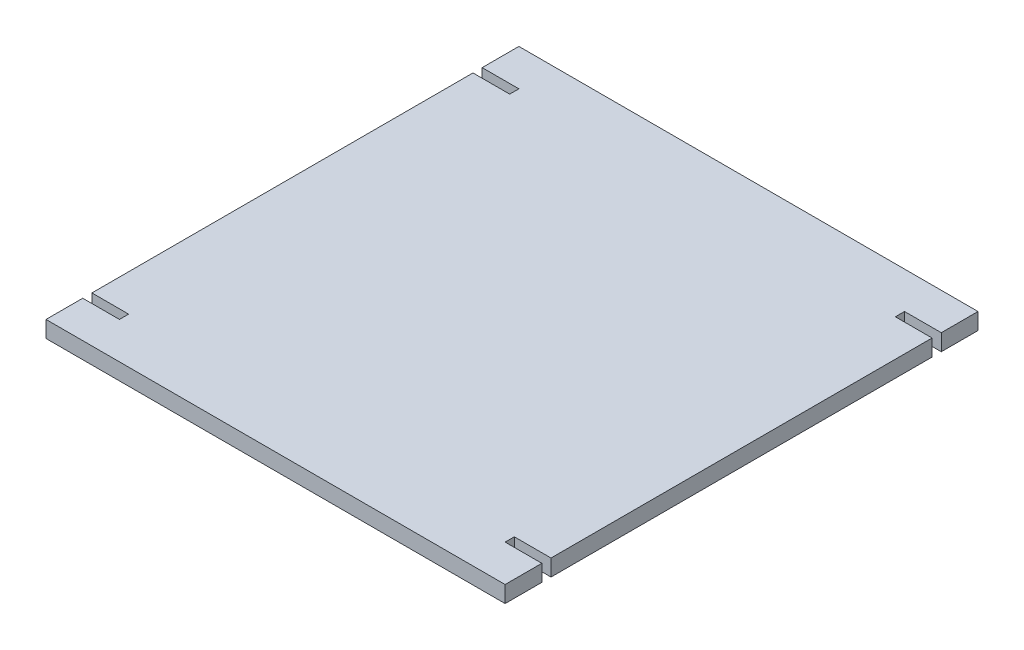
ISO-10303-21;
HEADER;
FILE_DESCRIPTION(('STEP AP214'),'2;1');
FILE_NAME('part.step','',(''),(''),'','','');
FILE_SCHEMA(('AUTOMOTIVE_DESIGN { 1 0 10303 214 1 1 1 1 }'));
ENDSEC;
DATA;
#1=APPLICATION_CONTEXT('core data for automotive mechanical design processes');
#2=APPLICATION_PROTOCOL_DEFINITION('international standard','automotive_design',2000,#1);
#3=PRODUCT_CONTEXT('',#1,'mechanical');
#4=PRODUCT('Part','Part','',(#3));
#5=PRODUCT_RELATED_PRODUCT_CATEGORY('part','',(#4));
#6=PRODUCT_DEFINITION_FORMATION('','',#4);
#7=PRODUCT_DEFINITION_CONTEXT('part definition',#1,'design');
#8=PRODUCT_DEFINITION('design','',#6,#7);
#9=PRODUCT_DEFINITION_SHAPE('','',#8);
#10=(LENGTH_UNIT() NAMED_UNIT(*) SI_UNIT(.MILLI.,.METRE.));
#11=(NAMED_UNIT(*) PLANE_ANGLE_UNIT() SI_UNIT($,.RADIAN.));
#12=(NAMED_UNIT(*) SI_UNIT($,.STERADIAN.) SOLID_ANGLE_UNIT());
#13=UNCERTAINTY_MEASURE_WITH_UNIT(LENGTH_MEASURE(1.E-05),#10,'distance_accuracy_value','');
#14=(GEOMETRIC_REPRESENTATION_CONTEXT(3) GLOBAL_UNCERTAINTY_ASSIGNED_CONTEXT((#13)) GLOBAL_UNIT_ASSIGNED_CONTEXT((#10,
#11,#12)) REPRESENTATION_CONTEXT('',''));
#15=CARTESIAN_POINT('',(0.,0.,0.));
#16=DIRECTION('',(0.,0.,1.));
#17=DIRECTION('',(1.,0.,0.));
#18=AXIS2_PLACEMENT_3D('',#15,#16,#17);
#19=CARTESIAN_POINT('',(-301.875,18.,-168.229166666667));
#20=DIRECTION('',(1.,0.,0.));
#21=DIRECTION('',(0.,0.,-1.));
#22=AXIS2_PLACEMENT_3D('',#19,#20,#21);
#23=PLANE('',#22);
#24=DIRECTION('',(0.,0.,1.));
#25=VECTOR('',#24,1.);
#26=CARTESIAN_POINT('',(-301.875,0.,-168.229166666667));
#27=LINE('',#26,#25);
#28=CARTESIAN_POINT('',(-301.875,0.,-208.229166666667));
#29=VERTEX_POINT('',#28);
#30=CARTESIAN_POINT('',(-301.875,0.,-168.229166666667));
#31=VERTEX_POINT('',#30);
#32=EDGE_CURVE('E201',#29,#31,#27,.T.);
#33=ORIENTED_EDGE('',*,*,#32,.T.);
#34=DIRECTION('',(0.,-1.,0.));
#35=VECTOR('',#34,1.);
#36=CARTESIAN_POINT('',(-301.875,18.,-168.229166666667));
#37=LINE('',#36,#35);
#38=CARTESIAN_POINT('',(-301.875,18.,-168.229166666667));
#39=VERTEX_POINT('',#38);
#40=EDGE_CURVE('E11',#39,#31,#37,.T.);
#41=ORIENTED_EDGE('',*,*,#40,.F.);
#42=DIRECTION('',(0.,0.,1.));
#43=VECTOR('',#42,1.);
#44=CARTESIAN_POINT('',(-301.875,18.,-168.229166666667));
#45=LINE('',#44,#43);
#46=CARTESIAN_POINT('',(-301.875,18.,-208.229166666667));
#47=VERTEX_POINT('',#46);
#48=EDGE_CURVE('E239',#47,#39,#45,.T.);
#49=ORIENTED_EDGE('',*,*,#48,.F.);
#50=DIRECTION('',(0.,-1.,0.));
#51=VECTOR('',#50,1.);
#52=CARTESIAN_POINT('',(-301.875,18.,-208.229166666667));
#53=LINE('',#52,#51);
#54=EDGE_CURVE('E197',#47,#29,#53,.T.);
#55=ORIENTED_EDGE('',*,*,#54,.T.);
#56=EDGE_LOOP('',(#33,#41,#49,#55));
#57=FACE_BOUND('',#56,.T.);
#58=ADVANCED_FACE('F33',(#57),#23,.F.);
#59=CARTESIAN_POINT('',(-261.875,18.,-168.229166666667));
#60=DIRECTION('',(0.,0.,-1.));
#61=DIRECTION('',(-1.,0.,0.));
#62=AXIS2_PLACEMENT_3D('',#59,#60,#61);
#63=PLANE('',#62);
#64=DIRECTION('',(1.,0.,0.));
#65=VECTOR('',#64,1.);
#66=CARTESIAN_POINT('',(-261.875,0.,-168.229166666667));
#67=LINE('',#66,#65);
#68=CARTESIAN_POINT('',(-261.875,0.,-168.229166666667));
#69=VERTEX_POINT('',#68);
#70=EDGE_CURVE('E204',#31,#69,#67,.T.);
#71=ORIENTED_EDGE('',*,*,#70,.T.);
#72=DIRECTION('',(0.,-1.,0.));
#73=VECTOR('',#72,1.);
#74=CARTESIAN_POINT('',(-261.875,18.,-168.229166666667));
#75=LINE('',#74,#73);
#76=CARTESIAN_POINT('',(-261.875,18.,-168.229166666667));
#77=VERTEX_POINT('',#76);
#78=EDGE_CURVE('E41',#77,#69,#75,.T.);
#79=ORIENTED_EDGE('',*,*,#78,.F.);
#80=DIRECTION('',(1.,0.,0.));
#81=VECTOR('',#80,1.);
#82=CARTESIAN_POINT('',(-261.875,18.,-168.229166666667));
#83=LINE('',#82,#81);
#84=EDGE_CURVE('E128',#39,#77,#83,.T.);
#85=ORIENTED_EDGE('',*,*,#84,.F.);
#86=ORIENTED_EDGE('',*,*,#40,.T.);
#87=EDGE_LOOP('',(#71,#79,#85,#86));
#88=FACE_BOUND('',#87,.T.);
#89=ADVANCED_FACE('F357',(#88),#63,.F.);
#90=CARTESIAN_POINT('',(-261.875,18.,-158.229166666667));
#91=DIRECTION('',(1.,0.,0.));
#92=DIRECTION('',(0.,0.,-1.));
#93=AXIS2_PLACEMENT_3D('',#90,#91,#92);
#94=PLANE('',#93);
#95=DIRECTION('',(0.,0.,1.));
#96=VECTOR('',#95,1.);
#97=CARTESIAN_POINT('',(-261.875,0.,-158.229166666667));
#98=LINE('',#97,#96);
#99=CARTESIAN_POINT('',(-261.875,0.,-158.229166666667));
#100=VERTEX_POINT('',#99);
#101=EDGE_CURVE('E206',#69,#100,#98,.T.);
#102=ORIENTED_EDGE('',*,*,#101,.T.);
#103=DIRECTION('',(0.,-1.,0.));
#104=VECTOR('',#103,1.);
#105=CARTESIAN_POINT('',(-261.875,18.,-158.229166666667));
#106=LINE('',#105,#104);
#107=CARTESIAN_POINT('',(-261.875,18.,-158.229166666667));
#108=VERTEX_POINT('',#107);
#109=EDGE_CURVE('E282',#108,#100,#106,.T.);
#110=ORIENTED_EDGE('',*,*,#109,.F.);
#111=DIRECTION('',(0.,0.,1.));
#112=VECTOR('',#111,1.);
#113=CARTESIAN_POINT('',(-261.875,18.,-158.229166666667));
#114=LINE('',#113,#112);
#115=EDGE_CURVE('E290',#77,#108,#114,.T.);
#116=ORIENTED_EDGE('',*,*,#115,.F.);
#117=ORIENTED_EDGE('',*,*,#78,.T.);
#118=EDGE_LOOP('',(#102,#110,#116,#117));
#119=FACE_BOUND('',#118,.T.);
#120=ADVANCED_FACE('F288',(#119),#94,.F.);
#121=CARTESIAN_POINT('',(-301.875,18.,-158.229166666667));
#122=DIRECTION('',(0.,0.,1.));
#123=DIRECTION('',(1.,0.,0.));
#124=AXIS2_PLACEMENT_3D('',#121,#122,#123);
#125=PLANE('',#124);
#126=DIRECTION('',(-1.,0.,0.));
#127=VECTOR('',#126,1.);
#128=CARTESIAN_POINT('',(-301.875,0.,-158.229166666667));
#129=LINE('',#128,#127);
#130=CARTESIAN_POINT('',(-301.875,0.,-158.229166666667));
#131=VERTEX_POINT('',#130);
#132=EDGE_CURVE('E208',#100,#131,#129,.T.);
#133=ORIENTED_EDGE('',*,*,#132,.T.);
#134=DIRECTION('',(0.,-1.,0.));
#135=VECTOR('',#134,1.);
#136=CARTESIAN_POINT('',(-301.875,18.,-158.229166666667));
#137=LINE('',#136,#135);
#138=CARTESIAN_POINT('',(-301.875,18.,-158.229166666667));
#139=VERTEX_POINT('',#138);
#140=EDGE_CURVE('E279',#139,#131,#137,.T.);
#141=ORIENTED_EDGE('',*,*,#140,.F.);
#142=DIRECTION('',(-1.,0.,0.));
#143=VECTOR('',#142,1.);
#144=CARTESIAN_POINT('',(-301.875,18.,-158.229166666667));
#145=LINE('',#144,#143);
#146=EDGE_CURVE('E308',#108,#139,#145,.T.);
#147=ORIENTED_EDGE('',*,*,#146,.F.);
#148=ORIENTED_EDGE('',*,*,#109,.T.);
#149=EDGE_LOOP('',(#133,#141,#147,#148));
#150=FACE_BOUND('',#149,.T.);
#151=ADVANCED_FACE('F299',(#150),#125,.F.);
#152=CARTESIAN_POINT('',(-301.875,18.,256.770833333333));
#153=DIRECTION('',(1.,0.,0.));
#154=DIRECTION('',(0.,0.,-1.));
#155=AXIS2_PLACEMENT_3D('',#152,#153,#154);
#156=PLANE('',#155);
#157=DIRECTION('',(0.,0.,1.));
#158=VECTOR('',#157,1.);
#159=CARTESIAN_POINT('',(-301.875,0.,256.770833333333));
#160=LINE('',#159,#158);
#161=CARTESIAN_POINT('',(-301.875,0.,256.770833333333));
#162=VERTEX_POINT('',#161);
#163=EDGE_CURVE('E210',#131,#162,#160,.T.);
#164=ORIENTED_EDGE('',*,*,#163,.T.);
#165=DIRECTION('',(0.,-1.,0.));
#166=VECTOR('',#165,1.);
#167=CARTESIAN_POINT('',(-301.875,18.,256.770833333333));
#168=LINE('',#167,#166);
#169=CARTESIAN_POINT('',(-301.875,18.,256.770833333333));
#170=VERTEX_POINT('',#169);
#171=EDGE_CURVE('E276',#170,#162,#168,.T.);
#172=ORIENTED_EDGE('',*,*,#171,.F.);
#173=DIRECTION('',(0.,0.,1.));
#174=VECTOR('',#173,1.);
#175=CARTESIAN_POINT('',(-301.875,18.,256.770833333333));
#176=LINE('',#175,#174);
#177=EDGE_CURVE('E305',#139,#170,#176,.T.);
#178=ORIENTED_EDGE('',*,*,#177,.F.);
#179=ORIENTED_EDGE('',*,*,#140,.T.);
#180=EDGE_LOOP('',(#164,#172,#178,#179));
#181=FACE_BOUND('',#180,.T.);
#182=ADVANCED_FACE('F303',(#181),#156,.F.);
#183=CARTESIAN_POINT('',(-261.875,18.,256.770833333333));
#184=DIRECTION('',(0.,0.,-1.));
#185=DIRECTION('',(-1.,0.,0.));
#186=AXIS2_PLACEMENT_3D('',#183,#184,#185);
#187=PLANE('',#186);
#188=DIRECTION('',(1.,0.,0.));
#189=VECTOR('',#188,1.);
#190=CARTESIAN_POINT('',(-261.875,0.,256.770833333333));
#191=LINE('',#190,#189);
#192=CARTESIAN_POINT('',(-261.875,0.,256.770833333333));
#193=VERTEX_POINT('',#192);
#194=EDGE_CURVE('E212',#162,#193,#191,.T.);
#195=ORIENTED_EDGE('',*,*,#194,.T.);
#196=DIRECTION('',(0.,-1.,0.));
#197=VECTOR('',#196,1.);
#198=CARTESIAN_POINT('',(-261.875,18.,256.770833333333));
#199=LINE('',#198,#197);
#200=CARTESIAN_POINT('',(-261.875,18.,256.770833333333));
#201=VERTEX_POINT('',#200);
#202=EDGE_CURVE('E273',#201,#193,#199,.T.);
#203=ORIENTED_EDGE('',*,*,#202,.F.);
#204=DIRECTION('',(1.,0.,0.));
#205=VECTOR('',#204,1.);
#206=CARTESIAN_POINT('',(-261.875,18.,256.770833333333));
#207=LINE('',#206,#205);
#208=EDGE_CURVE('E307',#170,#201,#207,.T.);
#209=ORIENTED_EDGE('',*,*,#208,.F.);
#210=ORIENTED_EDGE('',*,*,#171,.T.);
#211=EDGE_LOOP('',(#195,#203,#209,#210));
#212=FACE_BOUND('',#211,.T.);
#213=ADVANCED_FACE('F370',(#212),#187,.F.);
#214=CARTESIAN_POINT('',(-261.875,18.,266.770833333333));
#215=DIRECTION('',(1.,0.,0.));
#216=DIRECTION('',(0.,0.,-1.));
#217=AXIS2_PLACEMENT_3D('',#214,#215,#216);
#218=PLANE('',#217);
#219=DIRECTION('',(0.,0.,1.));
#220=VECTOR('',#219,1.);
#221=CARTESIAN_POINT('',(-261.875,0.,266.770833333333));
#222=LINE('',#221,#220);
#223=CARTESIAN_POINT('',(-261.875,0.,266.770833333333));
#224=VERTEX_POINT('',#223);
#225=EDGE_CURVE('E214',#193,#224,#222,.T.);
#226=ORIENTED_EDGE('',*,*,#225,.T.);
#227=DIRECTION('',(0.,-1.,0.));
#228=VECTOR('',#227,1.);
#229=CARTESIAN_POINT('',(-261.875,18.,266.770833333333));
#230=LINE('',#229,#228);
#231=CARTESIAN_POINT('',(-261.875,18.,266.770833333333));
#232=VERTEX_POINT('',#231);
#233=EDGE_CURVE('E270',#232,#224,#230,.T.);
#234=ORIENTED_EDGE('',*,*,#233,.F.);
#235=DIRECTION('',(0.,0.,1.));
#236=VECTOR('',#235,1.);
#237=CARTESIAN_POINT('',(-261.875,18.,266.770833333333));
#238=LINE('',#237,#236);
#239=EDGE_CURVE('E310',#201,#232,#238,.T.);
#240=ORIENTED_EDGE('',*,*,#239,.F.);
#241=ORIENTED_EDGE('',*,*,#202,.T.);
#242=EDGE_LOOP('',(#226,#234,#240,#241));
#243=FACE_BOUND('',#242,.T.);
#244=ADVANCED_FACE('F373',(#243),#218,.F.);
#245=CARTESIAN_POINT('',(-301.875,18.,266.770833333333));
#246=DIRECTION('',(0.,0.,1.));
#247=DIRECTION('',(1.,0.,0.));
#248=AXIS2_PLACEMENT_3D('',#245,#246,#247);
#249=PLANE('',#248);
#250=DIRECTION('',(-1.,0.,0.));
#251=VECTOR('',#250,1.);
#252=CARTESIAN_POINT('',(-301.875,0.,266.770833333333));
#253=LINE('',#252,#251);
#254=CARTESIAN_POINT('',(-301.875,0.,266.770833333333));
#255=VERTEX_POINT('',#254);
#256=EDGE_CURVE('E216',#224,#255,#253,.T.);
#257=ORIENTED_EDGE('',*,*,#256,.T.);
#258=DIRECTION('',(0.,-1.,0.));
#259=VECTOR('',#258,1.);
#260=CARTESIAN_POINT('',(-301.875,18.,266.770833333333));
#261=LINE('',#260,#259);
#262=CARTESIAN_POINT('',(-301.875,18.,266.770833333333));
#263=VERTEX_POINT('',#262);
#264=EDGE_CURVE('E267',#263,#255,#261,.T.);
#265=ORIENTED_EDGE('',*,*,#264,.F.);
#266=DIRECTION('',(-1.,0.,0.));
#267=VECTOR('',#266,1.);
#268=CARTESIAN_POINT('',(-301.875,18.,266.770833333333));
#269=LINE('',#268,#267);
#270=EDGE_CURVE('E316',#232,#263,#269,.T.);
#271=ORIENTED_EDGE('',*,*,#270,.F.);
#272=ORIENTED_EDGE('',*,*,#233,.T.);
#273=EDGE_LOOP('',(#257,#265,#271,#272));
#274=FACE_BOUND('',#273,.T.);
#275=ADVANCED_FACE('F377',(#274),#249,.F.);
#276=CARTESIAN_POINT('',(-301.875,18.,306.770833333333));
#277=DIRECTION('',(1.,0.,0.));
#278=DIRECTION('',(0.,0.,-1.));
#279=AXIS2_PLACEMENT_3D('',#276,#277,#278);
#280=PLANE('',#279);
#281=DIRECTION('',(0.,0.,1.));
#282=VECTOR('',#281,1.);
#283=CARTESIAN_POINT('',(-301.875,0.,306.770833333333));
#284=LINE('',#283,#282);
#285=CARTESIAN_POINT('',(-301.875,0.,306.770833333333));
#286=VERTEX_POINT('',#285);
#287=EDGE_CURVE('E218',#255,#286,#284,.T.);
#288=ORIENTED_EDGE('',*,*,#287,.T.);
#289=DIRECTION('',(0.,-1.,0.));
#290=VECTOR('',#289,1.);
#291=CARTESIAN_POINT('',(-301.875,18.,306.770833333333));
#292=LINE('',#291,#290);
#293=CARTESIAN_POINT('',(-301.875,18.,306.770833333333));
#294=VERTEX_POINT('',#293);
#295=EDGE_CURVE('E264',#294,#286,#292,.T.);
#296=ORIENTED_EDGE('',*,*,#295,.F.);
#297=DIRECTION('',(0.,0.,1.));
#298=VECTOR('',#297,1.);
#299=CARTESIAN_POINT('',(-301.875,18.,306.770833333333));
#300=LINE('',#299,#298);
#301=EDGE_CURVE('E318',#263,#294,#300,.T.);
#302=ORIENTED_EDGE('',*,*,#301,.F.);
#303=ORIENTED_EDGE('',*,*,#264,.T.);
#304=EDGE_LOOP('',(#288,#296,#302,#303));
#305=FACE_BOUND('',#304,.T.);
#306=ADVANCED_FACE('F381',(#305),#280,.F.);
#307=CARTESIAN_POINT('',(198.125,18.,306.770833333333));
#308=DIRECTION('',(0.,0.,-1.));
#309=DIRECTION('',(-1.,0.,0.));
#310=AXIS2_PLACEMENT_3D('',#307,#308,#309);
#311=PLANE('',#310);
#312=DIRECTION('',(1.,0.,0.));
#313=VECTOR('',#312,1.);
#314=CARTESIAN_POINT('',(198.125,0.,306.770833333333));
#315=LINE('',#314,#313);
#316=CARTESIAN_POINT('',(198.125,0.,306.770833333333));
#317=VERTEX_POINT('',#316);
#318=EDGE_CURVE('E220',#286,#317,#315,.T.);
#319=ORIENTED_EDGE('',*,*,#318,.T.);
#320=DIRECTION('',(0.,-1.,0.));
#321=VECTOR('',#320,1.);
#322=CARTESIAN_POINT('',(198.125,18.,306.770833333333));
#323=LINE('',#322,#321);
#324=CARTESIAN_POINT('',(198.125,18.,306.770833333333));
#325=VERTEX_POINT('',#324);
#326=EDGE_CURVE('E261',#325,#317,#323,.T.);
#327=ORIENTED_EDGE('',*,*,#326,.F.);
#328=DIRECTION('',(1.,0.,0.));
#329=VECTOR('',#328,1.);
#330=CARTESIAN_POINT('',(198.125,18.,306.770833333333));
#331=LINE('',#330,#329);
#332=EDGE_CURVE('E320',#294,#325,#331,.T.);
#333=ORIENTED_EDGE('',*,*,#332,.F.);
#334=ORIENTED_EDGE('',*,*,#295,.T.);
#335=EDGE_LOOP('',(#319,#327,#333,#334));
#336=FACE_BOUND('',#335,.T.);
#337=ADVANCED_FACE('F385',(#336),#311,.F.);
#338=CARTESIAN_POINT('',(198.125,18.,266.770833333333));
#339=DIRECTION('',(-1.,0.,0.));
#340=DIRECTION('',(0.,0.,1.));
#341=AXIS2_PLACEMENT_3D('',#338,#339,#340);
#342=PLANE('',#341);
#343=DIRECTION('',(0.,0.,-1.));
#344=VECTOR('',#343,1.);
#345=CARTESIAN_POINT('',(198.125,0.,266.770833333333));
#346=LINE('',#345,#344);
#347=CARTESIAN_POINT('',(198.125,0.,266.770833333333));
#348=VERTEX_POINT('',#347);
#349=EDGE_CURVE('E222',#317,#348,#346,.T.);
#350=ORIENTED_EDGE('',*,*,#349,.T.);
#351=DIRECTION('',(0.,-1.,0.));
#352=VECTOR('',#351,1.);
#353=CARTESIAN_POINT('',(198.125,18.,266.770833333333));
#354=LINE('',#353,#352);
#355=CARTESIAN_POINT('',(198.125,18.,266.770833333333));
#356=VERTEX_POINT('',#355);
#357=EDGE_CURVE('E258',#356,#348,#354,.T.);
#358=ORIENTED_EDGE('',*,*,#357,.F.);
#359=DIRECTION('',(0.,0.,-1.));
#360=VECTOR('',#359,1.);
#361=CARTESIAN_POINT('',(198.125,18.,266.770833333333));
#362=LINE('',#361,#360);
#363=EDGE_CURVE('E322',#325,#356,#362,.T.);
#364=ORIENTED_EDGE('',*,*,#363,.F.);
#365=ORIENTED_EDGE('',*,*,#326,.T.);
#366=EDGE_LOOP('',(#350,#358,#364,#365));
#367=FACE_BOUND('',#366,.T.);
#368=ADVANCED_FACE('F389',(#367),#342,.F.);
#369=CARTESIAN_POINT('',(158.125,18.,266.770833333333));
#370=DIRECTION('',(0.,0.,1.));
#371=DIRECTION('',(1.,0.,0.));
#372=AXIS2_PLACEMENT_3D('',#369,#370,#371);
#373=PLANE('',#372);
#374=DIRECTION('',(-1.,0.,0.));
#375=VECTOR('',#374,1.);
#376=CARTESIAN_POINT('',(158.125,0.,266.770833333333));
#377=LINE('',#376,#375);
#378=CARTESIAN_POINT('',(158.125,0.,266.770833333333));
#379=VERTEX_POINT('',#378);
#380=EDGE_CURVE('E224',#348,#379,#377,.T.);
#381=ORIENTED_EDGE('',*,*,#380,.T.);
#382=DIRECTION('',(0.,-1.,0.));
#383=VECTOR('',#382,1.);
#384=CARTESIAN_POINT('',(158.125,18.,266.770833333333));
#385=LINE('',#384,#383);
#386=CARTESIAN_POINT('',(158.125,18.,266.770833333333));
#387=VERTEX_POINT('',#386);
#388=EDGE_CURVE('E255',#387,#379,#385,.T.);
#389=ORIENTED_EDGE('',*,*,#388,.F.);
#390=DIRECTION('',(-1.,0.,0.));
#391=VECTOR('',#390,1.);
#392=CARTESIAN_POINT('',(158.125,18.,266.770833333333));
#393=LINE('',#392,#391);
#394=EDGE_CURVE('E324',#356,#387,#393,.T.);
#395=ORIENTED_EDGE('',*,*,#394,.F.);
#396=ORIENTED_EDGE('',*,*,#357,.T.);
#397=EDGE_LOOP('',(#381,#389,#395,#396));
#398=FACE_BOUND('',#397,.T.);
#399=ADVANCED_FACE('F393',(#398),#373,.F.);
#400=CARTESIAN_POINT('',(158.125,18.,256.770833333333));
#401=DIRECTION('',(-1.,0.,0.));
#402=DIRECTION('',(0.,0.,1.));
#403=AXIS2_PLACEMENT_3D('',#400,#401,#402);
#404=PLANE('',#403);
#405=DIRECTION('',(0.,0.,-1.));
#406=VECTOR('',#405,1.);
#407=CARTESIAN_POINT('',(158.125,0.,256.770833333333));
#408=LINE('',#407,#406);
#409=CARTESIAN_POINT('',(158.125,0.,256.770833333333));
#410=VERTEX_POINT('',#409);
#411=EDGE_CURVE('E226',#379,#410,#408,.T.);
#412=ORIENTED_EDGE('',*,*,#411,.T.);
#413=DIRECTION('',(0.,-1.,0.));
#414=VECTOR('',#413,1.);
#415=CARTESIAN_POINT('',(158.125,18.,256.770833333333));
#416=LINE('',#415,#414);
#417=CARTESIAN_POINT('',(158.125,18.,256.770833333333));
#418=VERTEX_POINT('',#417);
#419=EDGE_CURVE('E252',#418,#410,#416,.T.);
#420=ORIENTED_EDGE('',*,*,#419,.F.);
#421=DIRECTION('',(0.,0.,-1.));
#422=VECTOR('',#421,1.);
#423=CARTESIAN_POINT('',(158.125,18.,256.770833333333));
#424=LINE('',#423,#422);
#425=EDGE_CURVE('E326',#387,#418,#424,.T.);
#426=ORIENTED_EDGE('',*,*,#425,.F.);
#427=ORIENTED_EDGE('',*,*,#388,.T.);
#428=EDGE_LOOP('',(#412,#420,#426,#427));
#429=FACE_BOUND('',#428,.T.);
#430=ADVANCED_FACE('F397',(#429),#404,.F.);
#431=CARTESIAN_POINT('',(198.125,18.,256.770833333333));
#432=DIRECTION('',(0.,0.,-1.));
#433=DIRECTION('',(-1.,0.,0.));
#434=AXIS2_PLACEMENT_3D('',#431,#432,#433);
#435=PLANE('',#434);
#436=DIRECTION('',(1.,0.,0.));
#437=VECTOR('',#436,1.);
#438=CARTESIAN_POINT('',(198.125,0.,256.770833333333));
#439=LINE('',#438,#437);
#440=CARTESIAN_POINT('',(198.125,0.,256.770833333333));
#441=VERTEX_POINT('',#440);
#442=EDGE_CURVE('E228',#410,#441,#439,.T.);
#443=ORIENTED_EDGE('',*,*,#442,.T.);
#444=DIRECTION('',(0.,-1.,0.));
#445=VECTOR('',#444,1.);
#446=CARTESIAN_POINT('',(198.125,18.,256.770833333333));
#447=LINE('',#446,#445);
#448=CARTESIAN_POINT('',(198.125,18.,256.770833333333));
#449=VERTEX_POINT('',#448);
#450=EDGE_CURVE('E249',#449,#441,#447,.T.);
#451=ORIENTED_EDGE('',*,*,#450,.F.);
#452=DIRECTION('',(1.,0.,0.));
#453=VECTOR('',#452,1.);
#454=CARTESIAN_POINT('',(198.125,18.,256.770833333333));
#455=LINE('',#454,#453);
#456=EDGE_CURVE('E328',#418,#449,#455,.T.);
#457=ORIENTED_EDGE('',*,*,#456,.F.);
#458=ORIENTED_EDGE('',*,*,#419,.T.);
#459=EDGE_LOOP('',(#443,#451,#457,#458));
#460=FACE_BOUND('',#459,.T.);
#461=ADVANCED_FACE('F401',(#460),#435,.F.);
#462=CARTESIAN_POINT('',(198.125,18.,-158.229166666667));
#463=DIRECTION('',(-1.,0.,0.));
#464=DIRECTION('',(0.,0.,1.));
#465=AXIS2_PLACEMENT_3D('',#462,#463,#464);
#466=PLANE('',#465);
#467=DIRECTION('',(0.,0.,-1.));
#468=VECTOR('',#467,1.);
#469=CARTESIAN_POINT('',(198.125,0.,-158.229166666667));
#470=LINE('',#469,#468);
#471=CARTESIAN_POINT('',(198.125,0.,-158.229166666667));
#472=VERTEX_POINT('',#471);
#473=EDGE_CURVE('E230',#441,#472,#470,.T.);
#474=ORIENTED_EDGE('',*,*,#473,.T.);
#475=DIRECTION('',(0.,-1.,0.));
#476=VECTOR('',#475,1.);
#477=CARTESIAN_POINT('',(198.125,18.,-158.229166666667));
#478=LINE('',#477,#476);
#479=CARTESIAN_POINT('',(198.125,18.,-158.229166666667));
#480=VERTEX_POINT('',#479);
#481=EDGE_CURVE('E246',#480,#472,#478,.T.);
#482=ORIENTED_EDGE('',*,*,#481,.F.);
#483=DIRECTION('',(0.,0.,-1.));
#484=VECTOR('',#483,1.);
#485=CARTESIAN_POINT('',(198.125,18.,-158.229166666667));
#486=LINE('',#485,#484);
#487=EDGE_CURVE('E330',#449,#480,#486,.T.);
#488=ORIENTED_EDGE('',*,*,#487,.F.);
#489=ORIENTED_EDGE('',*,*,#450,.T.);
#490=EDGE_LOOP('',(#474,#482,#488,#489));
#491=FACE_BOUND('',#490,.T.);
#492=ADVANCED_FACE('F405',(#491),#466,.F.);
#493=CARTESIAN_POINT('',(158.125,18.,-158.229166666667));
#494=DIRECTION('',(0.,0.,1.));
#495=DIRECTION('',(1.,0.,0.));
#496=AXIS2_PLACEMENT_3D('',#493,#494,#495);
#497=PLANE('',#496);
#498=DIRECTION('',(-1.,0.,0.));
#499=VECTOR('',#498,1.);
#500=CARTESIAN_POINT('',(158.125,0.,-158.229166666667));
#501=LINE('',#500,#499);
#502=CARTESIAN_POINT('',(158.125,0.,-158.229166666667));
#503=VERTEX_POINT('',#502);
#504=EDGE_CURVE('E232',#472,#503,#501,.T.);
#505=ORIENTED_EDGE('',*,*,#504,.T.);
#506=DIRECTION('',(0.,-1.,0.));
#507=VECTOR('',#506,1.);
#508=CARTESIAN_POINT('',(158.125,18.,-158.229166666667));
#509=LINE('',#508,#507);
#510=CARTESIAN_POINT('',(158.125,18.,-158.229166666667));
#511=VERTEX_POINT('',#510);
#512=EDGE_CURVE('E243',#511,#503,#509,.T.);
#513=ORIENTED_EDGE('',*,*,#512,.F.);
#514=DIRECTION('',(-1.,0.,0.));
#515=VECTOR('',#514,1.);
#516=CARTESIAN_POINT('',(158.125,18.,-158.229166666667));
#517=LINE('',#516,#515);
#518=EDGE_CURVE('E332',#480,#511,#517,.T.);
#519=ORIENTED_EDGE('',*,*,#518,.F.);
#520=ORIENTED_EDGE('',*,*,#481,.T.);
#521=EDGE_LOOP('',(#505,#513,#519,#520));
#522=FACE_BOUND('',#521,.T.);
#523=ADVANCED_FACE('F338',(#522),#497,.F.);
#524=CARTESIAN_POINT('',(158.125,18.,-168.229166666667));
#525=DIRECTION('',(-1.,0.,0.));
#526=DIRECTION('',(0.,0.,1.));
#527=AXIS2_PLACEMENT_3D('',#524,#525,#526);
#528=PLANE('',#527);
#529=DIRECTION('',(0.,0.,-1.));
#530=VECTOR('',#529,1.);
#531=CARTESIAN_POINT('',(158.125,0.,-168.229166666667));
#532=LINE('',#531,#530);
#533=CARTESIAN_POINT('',(158.125,0.,-168.229166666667));
#534=VERTEX_POINT('',#533);
#535=EDGE_CURVE('E234',#503,#534,#532,.T.);
#536=ORIENTED_EDGE('',*,*,#535,.T.);
#537=DIRECTION('',(0.,-1.,0.));
#538=VECTOR('',#537,1.);
#539=CARTESIAN_POINT('',(158.125,18.,-168.229166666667));
#540=LINE('',#539,#538);
#541=CARTESIAN_POINT('',(158.125,18.,-168.229166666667));
#542=VERTEX_POINT('',#541);
#543=EDGE_CURVE('E192',#542,#534,#540,.T.);
#544=ORIENTED_EDGE('',*,*,#543,.F.);
#545=DIRECTION('',(0.,0.,-1.));
#546=VECTOR('',#545,1.);
#547=CARTESIAN_POINT('',(158.125,18.,-168.229166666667));
#548=LINE('',#547,#546);
#549=EDGE_CURVE('E183',#511,#542,#548,.T.);
#550=ORIENTED_EDGE('',*,*,#549,.F.);
#551=ORIENTED_EDGE('',*,*,#512,.T.);
#552=EDGE_LOOP('',(#536,#544,#550,#551));
#553=FACE_BOUND('',#552,.T.);
#554=ADVANCED_FACE('F342',(#553),#528,.F.);
#555=CARTESIAN_POINT('',(198.125,18.,-168.229166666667));
#556=DIRECTION('',(0.,0.,-1.));
#557=DIRECTION('',(-1.,0.,0.));
#558=AXIS2_PLACEMENT_3D('',#555,#556,#557);
#559=PLANE('',#558);
#560=DIRECTION('',(1.,0.,0.));
#561=VECTOR('',#560,1.);
#562=CARTESIAN_POINT('',(198.125,0.,-168.229166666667));
#563=LINE('',#562,#561);
#564=CARTESIAN_POINT('',(198.125,0.,-168.229166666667));
#565=VERTEX_POINT('',#564);
#566=EDGE_CURVE('E191',#534,#565,#563,.T.);
#567=ORIENTED_EDGE('',*,*,#566,.T.);
#568=DIRECTION('',(0.,-1.,0.));
#569=VECTOR('',#568,1.);
#570=CARTESIAN_POINT('',(198.125,18.,-168.229166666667));
#571=LINE('',#570,#569);
#572=CARTESIAN_POINT('',(198.125,18.,-168.229166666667));
#573=VERTEX_POINT('',#572);
#574=EDGE_CURVE('E188',#573,#565,#571,.T.);
#575=ORIENTED_EDGE('',*,*,#574,.F.);
#576=DIRECTION('',(1.,0.,0.));
#577=VECTOR('',#576,1.);
#578=CARTESIAN_POINT('',(198.125,18.,-168.229166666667));
#579=LINE('',#578,#577);
#580=EDGE_CURVE('E177',#542,#573,#579,.T.);
#581=ORIENTED_EDGE('',*,*,#580,.F.);
#582=ORIENTED_EDGE('',*,*,#543,.T.);
#583=EDGE_LOOP('',(#567,#575,#581,#582));
#584=FACE_BOUND('',#583,.T.);
#585=ADVANCED_FACE('F189',(#584),#559,.F.);
#586=CARTESIAN_POINT('',(198.125,18.,-208.229166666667));
#587=DIRECTION('',(-1.,0.,0.));
#588=DIRECTION('',(0.,0.,1.));
#589=AXIS2_PLACEMENT_3D('',#586,#587,#588);
#590=PLANE('',#589);
#591=DIRECTION('',(0.,0.,-1.));
#592=VECTOR('',#591,1.);
#593=CARTESIAN_POINT('',(198.125,0.,-208.229166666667));
#594=LINE('',#593,#592);
#595=CARTESIAN_POINT('',(198.125,0.,-208.229166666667));
#596=VERTEX_POINT('',#595);
#597=EDGE_CURVE('E114',#565,#596,#594,.T.);
#598=ORIENTED_EDGE('',*,*,#597,.T.);
#599=DIRECTION('',(0.,-1.,0.));
#600=VECTOR('',#599,1.);
#601=CARTESIAN_POINT('',(198.125,18.,-208.229166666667));
#602=LINE('',#601,#600);
#603=CARTESIAN_POINT('',(198.125,18.,-208.229166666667));
#604=VERTEX_POINT('',#603);
#605=EDGE_CURVE('E193',#604,#596,#602,.T.);
#606=ORIENTED_EDGE('',*,*,#605,.F.);
#607=DIRECTION('',(0.,0.,-1.));
#608=VECTOR('',#607,1.);
#609=CARTESIAN_POINT('',(198.125,18.,-208.229166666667));
#610=LINE('',#609,#608);
#611=EDGE_CURVE('E181',#573,#604,#610,.T.);
#612=ORIENTED_EDGE('',*,*,#611,.F.);
#613=ORIENTED_EDGE('',*,*,#574,.T.);
#614=EDGE_LOOP('',(#598,#606,#612,#613));
#615=FACE_BOUND('',#614,.T.);
#616=ADVANCED_FACE('F195',(#615),#590,.F.);
#617=CARTESIAN_POINT('',(-301.875,18.,-208.229166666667));
#618=DIRECTION('',(0.,0.,1.));
#619=DIRECTION('',(1.,0.,0.));
#620=AXIS2_PLACEMENT_3D('',#617,#618,#619);
#621=PLANE('',#620);
#622=DIRECTION('',(-1.,0.,0.));
#623=VECTOR('',#622,1.);
#624=CARTESIAN_POINT('',(-301.875,0.,-208.229166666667));
#625=LINE('',#624,#623);
#626=EDGE_CURVE('E120',#596,#29,#625,.T.);
#627=ORIENTED_EDGE('',*,*,#626,.T.);
#628=ORIENTED_EDGE('',*,*,#54,.F.);
#629=DIRECTION('',(-1.,0.,0.));
#630=VECTOR('',#629,1.);
#631=CARTESIAN_POINT('',(-301.875,18.,-208.229166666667));
#632=LINE('',#631,#630);
#633=EDGE_CURVE('E49',#604,#47,#632,.T.);
#634=ORIENTED_EDGE('',*,*,#633,.F.);
#635=ORIENTED_EDGE('',*,*,#605,.T.);
#636=EDGE_LOOP('',(#627,#628,#634,#635));
#637=FACE_BOUND('',#636,.T.);
#638=ADVANCED_FACE('F346',(#637),#621,.F.);
#639=CARTESIAN_POINT('',(0.,18.,0.));
#640=DIRECTION('',(0.,-1.,0.));
#641=DIRECTION('',(0.,0.,-1.));
#642=AXIS2_PLACEMENT_3D('',#639,#640,#641);
#643=PLANE('',#642);
#644=ORIENTED_EDGE('',*,*,#48,.T.);
#645=ORIENTED_EDGE('',*,*,#84,.T.);
#646=ORIENTED_EDGE('',*,*,#115,.T.);
#647=ORIENTED_EDGE('',*,*,#146,.T.);
#648=ORIENTED_EDGE('',*,*,#177,.T.);
#649=ORIENTED_EDGE('',*,*,#208,.T.);
#650=ORIENTED_EDGE('',*,*,#239,.T.);
#651=ORIENTED_EDGE('',*,*,#270,.T.);
#652=ORIENTED_EDGE('',*,*,#301,.T.);
#653=ORIENTED_EDGE('',*,*,#332,.T.);
#654=ORIENTED_EDGE('',*,*,#363,.T.);
#655=ORIENTED_EDGE('',*,*,#394,.T.);
#656=ORIENTED_EDGE('',*,*,#425,.T.);
#657=ORIENTED_EDGE('',*,*,#456,.T.);
#658=ORIENTED_EDGE('',*,*,#487,.T.);
#659=ORIENTED_EDGE('',*,*,#518,.T.);
#660=ORIENTED_EDGE('',*,*,#549,.T.);
#661=ORIENTED_EDGE('',*,*,#580,.T.);
#662=ORIENTED_EDGE('',*,*,#611,.T.);
#663=ORIENTED_EDGE('',*,*,#633,.T.);
#664=EDGE_LOOP('',(#644,#645,#646,#647,#648,#649,#650,#651,#652,#653,#654,#655,#656,#657,#658,
#659,#660,#661,#662,#663));
#665=FACE_BOUND('',#664,.T.);
#666=ADVANCED_FACE('F179',(#665),#643,.F.);
#667=CARTESIAN_POINT('',(0.,0.,0.));
#668=DIRECTION('',(0.,-1.,0.));
#669=DIRECTION('',(0.,0.,-1.));
#670=AXIS2_PLACEMENT_3D('',#667,#668,#669);
#671=PLANE('',#670);
#672=ORIENTED_EDGE('',*,*,#32,.F.);
#673=ORIENTED_EDGE('',*,*,#626,.F.);
#674=ORIENTED_EDGE('',*,*,#597,.F.);
#675=ORIENTED_EDGE('',*,*,#566,.F.);
#676=ORIENTED_EDGE('',*,*,#535,.F.);
#677=ORIENTED_EDGE('',*,*,#504,.F.);
#678=ORIENTED_EDGE('',*,*,#473,.F.);
#679=ORIENTED_EDGE('',*,*,#442,.F.);
#680=ORIENTED_EDGE('',*,*,#411,.F.);
#681=ORIENTED_EDGE('',*,*,#380,.F.);
#682=ORIENTED_EDGE('',*,*,#349,.F.);
#683=ORIENTED_EDGE('',*,*,#318,.F.);
#684=ORIENTED_EDGE('',*,*,#287,.F.);
#685=ORIENTED_EDGE('',*,*,#256,.F.);
#686=ORIENTED_EDGE('',*,*,#225,.F.);
#687=ORIENTED_EDGE('',*,*,#194,.F.);
#688=ORIENTED_EDGE('',*,*,#163,.F.);
#689=ORIENTED_EDGE('',*,*,#132,.F.);
#690=ORIENTED_EDGE('',*,*,#101,.F.);
#691=ORIENTED_EDGE('',*,*,#70,.F.);
#692=EDGE_LOOP('',(#672,#673,#674,#675,#676,#677,#678,#679,#680,#681,#682,#683,#684,#685,#686,
#687,#688,#689,#690,#691));
#693=FACE_BOUND('',#692,.T.);
#694=ADVANCED_FACE('F294',(#693),#671,.T.);
#695=CLOSED_SHELL('',(#58,#89,#120,#151,#182,#213,#244,#275,#306,#337,#368,#399,#430,#461,#492,
#523,#554,#585,#616,#638,#666,#694));
#696=MANIFOLD_SOLID_BREP('B2',#695);
#697=ADVANCED_BREP_SHAPE_REPRESENTATION('',(#18,#696),#14);
#698=SHAPE_DEFINITION_REPRESENTATION(#9,#697);
ENDSEC;
END-ISO-10303-21;
